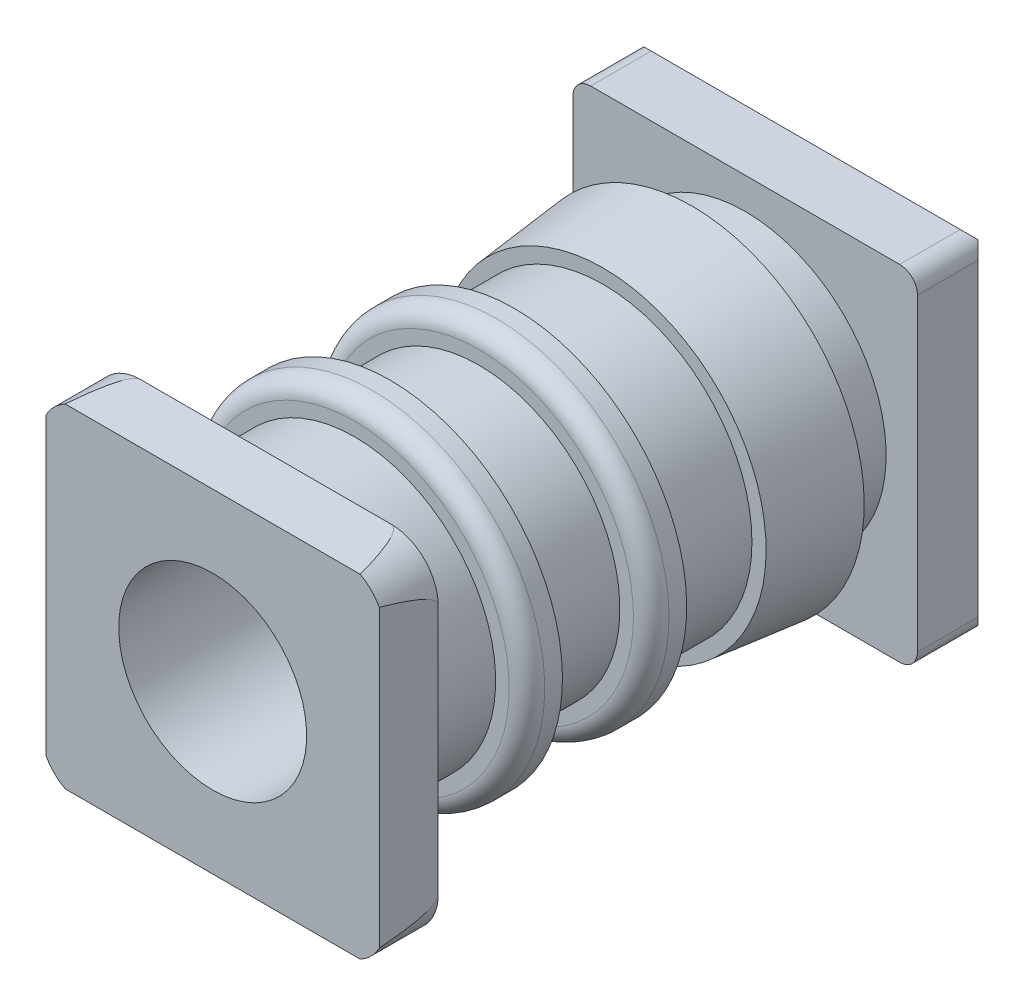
ISO-10303-21;
HEADER;
FILE_DESCRIPTION(('STEP AP214'),'2;1');
FILE_NAME('part.step','',(''),(''),'','','');
FILE_SCHEMA(('AUTOMOTIVE_DESIGN { 1 0 10303 214 1 1 1 1 }'));
ENDSEC;
DATA;
#1=APPLICATION_CONTEXT('core data for automotive mechanical design processes');
#2=APPLICATION_PROTOCOL_DEFINITION('international standard','automotive_design',2000,#1);
#3=PRODUCT_CONTEXT('',#1,'mechanical');
#4=PRODUCT('Part','Part','',(#3));
#5=PRODUCT_RELATED_PRODUCT_CATEGORY('part','',(#4));
#6=PRODUCT_DEFINITION_FORMATION('','',#4);
#7=PRODUCT_DEFINITION_CONTEXT('part definition',#1,'design');
#8=PRODUCT_DEFINITION('design','',#6,#7);
#9=PRODUCT_DEFINITION_SHAPE('','',#8);
#10=(LENGTH_UNIT() NAMED_UNIT(*) SI_UNIT(.MILLI.,.METRE.));
#11=(NAMED_UNIT(*) PLANE_ANGLE_UNIT() SI_UNIT($,.RADIAN.));
#12=(NAMED_UNIT(*) SI_UNIT($,.STERADIAN.) SOLID_ANGLE_UNIT());
#13=UNCERTAINTY_MEASURE_WITH_UNIT(LENGTH_MEASURE(1.E-05),#10,'distance_accuracy_value','');
#14=(GEOMETRIC_REPRESENTATION_CONTEXT(3) GLOBAL_UNCERTAINTY_ASSIGNED_CONTEXT((#13)) GLOBAL_UNIT_ASSIGNED_CONTEXT((#10,
#11,#12)) REPRESENTATION_CONTEXT('',''));
#15=CARTESIAN_POINT('',(0.,0.,0.));
#16=DIRECTION('',(0.,0.,1.));
#17=DIRECTION('',(1.,0.,0.));
#18=AXIS2_PLACEMENT_3D('',#15,#16,#17);
#19=CARTESIAN_POINT('',(-11.,-11.,30.6));
#20=DIRECTION('',(0.,0.,-1.));
#21=DIRECTION('',(0.,1.,0.));
#22=AXIS2_PLACEMENT_3D('',#19,#20,#21);
#23=PLANE('',#22);
#24=CARTESIAN_POINT('',(0.,0.,30.6));
#25=DIRECTION('',(0.,0.,-1.));
#26=DIRECTION('',(0.,1.,0.));
#27=AXIS2_PLACEMENT_3D('',#24,#25,#26);
#28=CIRCLE('',#27,9.);
#29=CARTESIAN_POINT('',(0.,9.,30.6));
#30=VERTEX_POINT('',#29);
#31=EDGE_CURVE('E289',#30,#30,#28,.F.);
#32=ORIENTED_EDGE('',*,*,#31,.T.);
#33=EDGE_LOOP('',(#32));
#34=FACE_BOUND('',#33,.T.);
#35=CARTESIAN_POINT('',(8.,8.,30.6));
#36=DIRECTION('',(0.,0.,-1.));
#37=DIRECTION('',(0.,1.,0.));
#38=AXIS2_PLACEMENT_3D('',#35,#36,#37);
#39=CIRCLE('',#38,3.);
#40=CARTESIAN_POINT('',(11.,8.,30.6));
#41=VERTEX_POINT('',#40);
#42=CARTESIAN_POINT('',(8.,11.,30.6));
#43=VERTEX_POINT('',#42);
#44=EDGE_CURVE('E396',#41,#43,#39,.F.);
#45=ORIENTED_EDGE('',*,*,#44,.F.);
#46=DIRECTION('',(0.,-1.,0.));
#47=VECTOR('',#46,1.);
#48=CARTESIAN_POINT('',(11.,-11.,30.6));
#49=LINE('',#48,#47);
#50=CARTESIAN_POINT('',(11.,-8.,30.6));
#51=VERTEX_POINT('',#50);
#52=EDGE_CURVE('E239',#51,#41,#49,.F.);
#53=ORIENTED_EDGE('',*,*,#52,.F.);
#54=CARTESIAN_POINT('',(8.,-8.,30.6));
#55=DIRECTION('',(0.,0.,-1.));
#56=DIRECTION('',(0.,1.,0.));
#57=AXIS2_PLACEMENT_3D('',#54,#55,#56);
#58=CIRCLE('',#57,3.);
#59=CARTESIAN_POINT('',(8.,-11.,30.6));
#60=VERTEX_POINT('',#59);
#61=EDGE_CURVE('E175',#60,#51,#58,.F.);
#62=ORIENTED_EDGE('',*,*,#61,.F.);
#63=DIRECTION('',(1.,0.,0.));
#64=VECTOR('',#63,1.);
#65=CARTESIAN_POINT('',(11.,-11.,30.6));
#66=LINE('',#65,#64);
#67=CARTESIAN_POINT('',(-8.,-11.,30.6));
#68=VERTEX_POINT('',#67);
#69=EDGE_CURVE('E241',#60,#68,#66,.F.);
#70=ORIENTED_EDGE('',*,*,#69,.T.);
#71=CARTESIAN_POINT('',(-8.,-8.,30.6));
#72=DIRECTION('',(0.,0.,-1.));
#73=DIRECTION('',(0.,1.,0.));
#74=AXIS2_PLACEMENT_3D('',#71,#72,#73);
#75=CIRCLE('',#74,3.);
#76=CARTESIAN_POINT('',(-11.,-8.,30.6));
#77=VERTEX_POINT('',#76);
#78=EDGE_CURVE('E31',#77,#68,#75,.F.);
#79=ORIENTED_EDGE('',*,*,#78,.F.);
#80=DIRECTION('',(0.,-1.,0.));
#81=VECTOR('',#80,1.);
#82=CARTESIAN_POINT('',(-11.,-11.,30.6));
#83=LINE('',#82,#81);
#84=CARTESIAN_POINT('',(-11.,8.,30.6));
#85=VERTEX_POINT('',#84);
#86=EDGE_CURVE('E244',#85,#77,#83,.T.);
#87=ORIENTED_EDGE('',*,*,#86,.F.);
#88=CARTESIAN_POINT('',(-8.,8.,30.6));
#89=DIRECTION('',(0.,0.,-1.));
#90=DIRECTION('',(0.,1.,0.));
#91=AXIS2_PLACEMENT_3D('',#88,#89,#90);
#92=CIRCLE('',#91,3.);
#93=CARTESIAN_POINT('',(-8.,11.,30.6));
#94=VERTEX_POINT('',#93);
#95=EDGE_CURVE('E413',#94,#85,#92,.F.);
#96=ORIENTED_EDGE('',*,*,#95,.F.);
#97=DIRECTION('',(1.,0.,0.));
#98=VECTOR('',#97,1.);
#99=CARTESIAN_POINT('',(11.,11.,30.6));
#100=LINE('',#99,#98);
#101=EDGE_CURVE('E247',#94,#43,#100,.T.);
#102=ORIENTED_EDGE('',*,*,#101,.T.);
#103=EDGE_LOOP('',(#45,#53,#62,#70,#79,#87,#96,#102));
#104=FACE_BOUND('',#103,.T.);
#105=ADVANCED_FACE('F14',(#34,#104),#23,.T.);
#106=CARTESIAN_POINT('',(4.5,0.,34.));
#107=DIRECTION('',(0.,0.,1.));
#108=DIRECTION('',(0.,-1.,0.));
#109=AXIS2_PLACEMENT_3D('',#106,#107,#108);
#110=PLANE('',#109);
#111=CARTESIAN_POINT('',(0.,0.,34.));
#112=DIRECTION('',(0.,0.,-1.));
#113=DIRECTION('',(0.,1.,0.));
#114=AXIS2_PLACEMENT_3D('',#111,#112,#113);
#115=CIRCLE('',#114,6.);
#116=CARTESIAN_POINT('',(0.,6.,34.));
#117=VERTEX_POINT('',#116);
#118=EDGE_CURVE('E417',#117,#117,#115,.T.);
#119=ORIENTED_EDGE('',*,*,#118,.T.);
#120=EDGE_LOOP('',(#119));
#121=FACE_BOUND('',#120,.T.);
#122=CARTESIAN_POINT('',(8.,8.,34.));
#123=DIRECTION('',(0.,0.,-1.));
#124=DIRECTION('',(0.,-1.,0.));
#125=AXIS2_PLACEMENT_3D('',#122,#123,#124);
#126=CIRCLE('',#125,3.);
#127=CARTESIAN_POINT('',(9.42000853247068,10.6426456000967,34.));
#128=VERTEX_POINT('',#127);
#129=CARTESIAN_POINT('',(10.6426456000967,9.42000853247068,34.));
#130=VERTEX_POINT('',#129);
#131=EDGE_CURVE('E38',#128,#130,#126,.T.);
#132=ORIENTED_EDGE('',*,*,#131,.F.);
#133=DIRECTION('',(1.,0.,0.));
#134=VECTOR('',#133,1.);
#135=CARTESIAN_POINT('',(4.5,10.6426456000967,34.));
#136=LINE('',#135,#134);
#137=CARTESIAN_POINT('',(-9.42000853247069,10.6426456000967,34.));
#138=VERTEX_POINT('',#137);
#139=EDGE_CURVE('E205',#128,#138,#136,.F.);
#140=ORIENTED_EDGE('',*,*,#139,.T.);
#141=CARTESIAN_POINT('',(-8.,8.,34.));
#142=DIRECTION('',(0.,0.,1.));
#143=DIRECTION('',(0.,-1.,0.));
#144=AXIS2_PLACEMENT_3D('',#141,#142,#143);
#145=CIRCLE('',#144,3.);
#146=CARTESIAN_POINT('',(-10.6426456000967,9.42000853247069,34.));
#147=VERTEX_POINT('',#146);
#148=EDGE_CURVE('E180',#147,#138,#145,.F.);
#149=ORIENTED_EDGE('',*,*,#148,.F.);
#150=DIRECTION('',(0.,-1.,0.));
#151=VECTOR('',#150,1.);
#152=CARTESIAN_POINT('',(-10.6426456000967,0.,34.));
#153=LINE('',#152,#151);
#154=CARTESIAN_POINT('',(-10.6426456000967,-9.42000853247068,34.));
#155=VERTEX_POINT('',#154);
#156=EDGE_CURVE('E197',#147,#155,#153,.T.);
#157=ORIENTED_EDGE('',*,*,#156,.T.);
#158=CARTESIAN_POINT('',(-8.,-8.,34.));
#159=DIRECTION('',(0.,0.,-1.));
#160=DIRECTION('',(0.,-1.,0.));
#161=AXIS2_PLACEMENT_3D('',#158,#159,#160);
#162=CIRCLE('',#161,3.);
#163=CARTESIAN_POINT('',(-9.42000853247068,-10.6426456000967,34.));
#164=VERTEX_POINT('',#163);
#165=EDGE_CURVE('E190',#164,#155,#162,.T.);
#166=ORIENTED_EDGE('',*,*,#165,.F.);
#167=DIRECTION('',(1.,0.,0.));
#168=VECTOR('',#167,1.);
#169=CARTESIAN_POINT('',(4.5,-10.6426456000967,34.));
#170=LINE('',#169,#168);
#171=CARTESIAN_POINT('',(9.42000853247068,-10.6426456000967,34.));
#172=VERTEX_POINT('',#171);
#173=EDGE_CURVE('E189',#164,#172,#170,.T.);
#174=ORIENTED_EDGE('',*,*,#173,.T.);
#175=CARTESIAN_POINT('',(8.,-8.,34.));
#176=DIRECTION('',(0.,0.,-1.));
#177=DIRECTION('',(0.,-1.,0.));
#178=AXIS2_PLACEMENT_3D('',#175,#176,#177);
#179=CIRCLE('',#178,3.);
#180=CARTESIAN_POINT('',(10.6426456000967,-9.42000853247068,34.));
#181=VERTEX_POINT('',#180);
#182=EDGE_CURVE('E172',#181,#172,#179,.T.);
#183=ORIENTED_EDGE('',*,*,#182,.F.);
#184=DIRECTION('',(0.,-1.,0.));
#185=VECTOR('',#184,1.);
#186=CARTESIAN_POINT('',(10.6426456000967,0.,34.));
#187=LINE('',#186,#185);
#188=EDGE_CURVE('E186',#181,#130,#187,.F.);
#189=ORIENTED_EDGE('',*,*,#188,.T.);
#190=EDGE_LOOP('',(#132,#140,#149,#157,#166,#174,#183,#189));
#191=FACE_BOUND('',#190,.T.);
#192=ADVANCED_FACE('F185',(#121,#191),#110,.T.);
#193=CARTESIAN_POINT('',(0.,0.,15.8666666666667));
#194=DIRECTION('',(0.,0.,1.));
#195=DIRECTION('',(0.,-1.,0.));
#196=AXIS2_PLACEMENT_3D('',#193,#194,#195);
#197=TOROIDAL_SURFACE('',#196,9.86666666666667,1.13333333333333);
#198=CARTESIAN_POINT('',(0.,0.,15.8666666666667));
#199=DIRECTION('',(0.,0.,-1.));
#200=DIRECTION('',(0.,1.,0.));
#201=AXIS2_PLACEMENT_3D('',#198,#199,#200);
#202=CIRCLE('',#201,11.);
#203=CARTESIAN_POINT('',(0.,11.,15.8666666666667));
#204=VERTEX_POINT('',#203);
#205=EDGE_CURVE('E419',#204,#204,#202,.T.);
#206=ORIENTED_EDGE('',*,*,#205,.F.);
#207=EDGE_LOOP('',(#206));
#208=FACE_BOUND('',#207,.T.);
#209=CARTESIAN_POINT('',(0.,0.,17.));
#210=DIRECTION('',(0.,0.,-1.));
#211=DIRECTION('',(0.,1.,0.));
#212=AXIS2_PLACEMENT_3D('',#209,#210,#211);
#213=CIRCLE('',#212,9.86666666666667);
#214=CARTESIAN_POINT('',(9.86666666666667,0.,17.));
#215=VERTEX_POINT('',#214);
#216=CARTESIAN_POINT('',(0.,9.86666666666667,17.));
#217=VERTEX_POINT('',#216);
#218=EDGE_CURVE('E423',#215,#217,#213,.F.);
#219=ORIENTED_EDGE('',*,*,#218,.F.);
#220=CARTESIAN_POINT('',(0.,0.,17.));
#221=DIRECTION('',(0.,0.,-1.));
#222=DIRECTION('',(1.,0.,0.));
#223=AXIS2_PLACEMENT_3D('',#220,#221,#222);
#224=CIRCLE('',#223,9.86666666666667);
#225=CARTESIAN_POINT('',(0.,-9.86666666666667,17.));
#226=VERTEX_POINT('',#225);
#227=EDGE_CURVE('E516',#226,#215,#224,.F.);
#228=ORIENTED_EDGE('',*,*,#227,.F.);
#229=CARTESIAN_POINT('',(0.,0.,17.));
#230=DIRECTION('',(0.,0.,-1.));
#231=DIRECTION('',(0.,-1.,0.));
#232=AXIS2_PLACEMENT_3D('',#229,#230,#231);
#233=CIRCLE('',#232,9.86666666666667);
#234=EDGE_CURVE('E384',#217,#226,#233,.F.);
#235=ORIENTED_EDGE('',*,*,#234,.F.);
#236=EDGE_LOOP('',(#219,#228,#235));
#237=FACE_BOUND('',#236,.T.);
#238=ADVANCED_FACE('F16',(#208,#237),#197,.T.);
#239=CARTESIAN_POINT('',(0.,0.,15.3));
#240=DIRECTION('',(0.,0.,-1.));
#241=DIRECTION('',(0.,1.,0.));
#242=AXIS2_PLACEMENT_3D('',#239,#240,#241);
#243=CYLINDRICAL_SURFACE('',#242,11.);
#244=ORIENTED_EDGE('',*,*,#205,.T.);
#245=EDGE_LOOP('',(#244));
#246=FACE_BOUND('',#245,.T.);
#247=CARTESIAN_POINT('',(0.,0.,14.7333333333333));
#248=DIRECTION('',(0.,0.,-1.));
#249=DIRECTION('',(0.,1.,0.));
#250=AXIS2_PLACEMENT_3D('',#247,#248,#249);
#251=CIRCLE('',#250,11.);
#252=CARTESIAN_POINT('',(0.,11.,14.7333333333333));
#253=VERTEX_POINT('',#252);
#254=EDGE_CURVE('E514',#253,#253,#251,.T.);
#255=ORIENTED_EDGE('',*,*,#254,.F.);
#256=EDGE_LOOP('',(#255));
#257=FACE_BOUND('',#256,.T.);
#258=ADVANCED_FACE('F539',(#246,#257),#243,.T.);
#259=CARTESIAN_POINT('',(9.43333333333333,0.,17.));
#260=DIRECTION('',(0.,0.,1.));
#261=DIRECTION('',(0.,-1.,0.));
#262=AXIS2_PLACEMENT_3D('',#259,#260,#261);
#263=PLANE('',#262);
#264=ORIENTED_EDGE('',*,*,#234,.T.);
#265=ORIENTED_EDGE('',*,*,#227,.T.);
#266=ORIENTED_EDGE('',*,*,#218,.T.);
#267=EDGE_LOOP('',(#264,#265,#266));
#268=FACE_BOUND('',#267,.T.);
#269=CARTESIAN_POINT('',(0.,0.,17.));
#270=DIRECTION('',(0.,0.,-1.));
#271=DIRECTION('',(0.,1.,0.));
#272=AXIS2_PLACEMENT_3D('',#269,#270,#271);
#273=CIRCLE('',#272,9.);
#274=CARTESIAN_POINT('',(0.,9.,17.));
#275=VERTEX_POINT('',#274);
#276=EDGE_CURVE('E512',#275,#275,#273,.F.);
#277=ORIENTED_EDGE('',*,*,#276,.F.);
#278=EDGE_LOOP('',(#277));
#279=FACE_BOUND('',#278,.T.);
#280=ADVANCED_FACE('F522',(#268,#279),#263,.T.);
#281=CARTESIAN_POINT('',(10.25,0.,14.7333333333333));
#282=DIRECTION('',(0.,0.,-1.));
#283=DIRECTION('',(0.,1.,0.));
#284=AXIS2_PLACEMENT_3D('',#281,#282,#283);
#285=PLANE('',#284);
#286=CARTESIAN_POINT('',(0.,0.,14.7333333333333));
#287=DIRECTION('',(0.,0.,-1.));
#288=DIRECTION('',(0.,1.,0.));
#289=AXIS2_PLACEMENT_3D('',#286,#287,#288);
#290=CIRCLE('',#289,9.5);
#291=CARTESIAN_POINT('',(0.,9.5,14.7333333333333));
#292=VERTEX_POINT('',#291);
#293=EDGE_CURVE('E509',#292,#292,#290,.T.);
#294=ORIENTED_EDGE('',*,*,#293,.F.);
#295=EDGE_LOOP('',(#294));
#296=FACE_BOUND('',#295,.T.);
#297=ORIENTED_EDGE('',*,*,#254,.T.);
#298=EDGE_LOOP('',(#297));
#299=FACE_BOUND('',#298,.T.);
#300=ADVANCED_FACE('F538',(#296,#299),#285,.T.);
#301=CARTESIAN_POINT('',(0.,0.,19.8333333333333));
#302=DIRECTION('',(0.,0.,-1.));
#303=DIRECTION('',(0.,1.,0.));
#304=AXIS2_PLACEMENT_3D('',#301,#302,#303);
#305=CYLINDRICAL_SURFACE('',#304,9.);
#306=CARTESIAN_POINT('',(0.,0.,22.6666666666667));
#307=DIRECTION('',(0.,0.,-1.));
#308=DIRECTION('',(0.,1.,0.));
#309=AXIS2_PLACEMENT_3D('',#306,#307,#308);
#310=CIRCLE('',#309,9.);
#311=CARTESIAN_POINT('',(0.,9.,22.6666666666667));
#312=VERTEX_POINT('',#311);
#313=EDGE_CURVE('E506',#312,#312,#310,.F.);
#314=ORIENTED_EDGE('',*,*,#313,.F.);
#315=EDGE_LOOP('',(#314));
#316=FACE_BOUND('',#315,.T.);
#317=ORIENTED_EDGE('',*,*,#276,.T.);
#318=EDGE_LOOP('',(#317));
#319=FACE_BOUND('',#318,.T.);
#320=ADVANCED_FACE('F682',(#316,#319),#305,.T.);
#321=CARTESIAN_POINT('',(0.,0.,11.9));
#322=DIRECTION('',(0.,0.,-1.));
#323=DIRECTION('',(0.,1.,0.));
#324=AXIS2_PLACEMENT_3D('',#321,#322,#323);
#325=CYLINDRICAL_SURFACE('',#324,9.5);
#326=ORIENTED_EDGE('',*,*,#293,.T.);
#327=EDGE_LOOP('',(#326));
#328=FACE_BOUND('',#327,.T.);
#329=CARTESIAN_POINT('',(0.,0.,9.0666666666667));
#330=DIRECTION('',(0.,0.,-1.));
#331=DIRECTION('',(0.,1.,0.));
#332=AXIS2_PLACEMENT_3D('',#329,#330,#331);
#333=CIRCLE('',#332,9.5);
#334=CARTESIAN_POINT('',(0.,9.5,9.0666666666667));
#335=VERTEX_POINT('',#334);
#336=EDGE_CURVE('E503',#335,#335,#333,.T.);
#337=ORIENTED_EDGE('',*,*,#336,.F.);
#338=EDGE_LOOP('',(#337));
#339=FACE_BOUND('',#338,.T.);
#340=ADVANCED_FACE('F680',(#328,#339),#325,.T.);
#341=CARTESIAN_POINT('',(10.,0.,22.6666666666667));
#342=DIRECTION('',(0.,0.,-1.));
#343=DIRECTION('',(0.,1.,0.));
#344=AXIS2_PLACEMENT_3D('',#341,#342,#343);
#345=PLANE('',#344);
#346=ORIENTED_EDGE('',*,*,#313,.T.);
#347=EDGE_LOOP('',(#346));
#348=FACE_BOUND('',#347,.T.);
#349=CARTESIAN_POINT('',(0.,0.,22.6666666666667));
#350=DIRECTION('',(0.,0.,-1.));
#351=DIRECTION('',(0.,1.,0.));
#352=AXIS2_PLACEMENT_3D('',#349,#350,#351);
#353=CIRCLE('',#352,11.);
#354=CARTESIAN_POINT('',(0.,11.,22.6666666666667));
#355=VERTEX_POINT('',#354);
#356=EDGE_CURVE('E500',#355,#355,#353,.F.);
#357=ORIENTED_EDGE('',*,*,#356,.F.);
#358=EDGE_LOOP('',(#357));
#359=FACE_BOUND('',#358,.T.);
#360=ADVANCED_FACE('F676',(#348,#359),#345,.T.);
#361=CARTESIAN_POINT('',(9.95220466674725,0.,9.0666666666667));
#362=DIRECTION('',(0.,0.,1.));
#363=DIRECTION('',(-1.,0.,0.));
#364=AXIS2_PLACEMENT_3D('',#361,#362,#363);
#365=PLANE('',#364);
#366=CARTESIAN_POINT('',(0.,0.,9.0666666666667));
#367=DIRECTION('',(0.,0.,-1.));
#368=DIRECTION('',(0.,1.,0.));
#369=AXIS2_PLACEMENT_3D('',#366,#367,#368);
#370=CIRCLE('',#369,10.4044093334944);
#371=CARTESIAN_POINT('',(0.,10.4044093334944,9.0666666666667));
#372=VERTEX_POINT('',#371);
#373=EDGE_CURVE('E497',#372,#372,#370,.T.);
#374=ORIENTED_EDGE('',*,*,#373,.F.);
#375=EDGE_LOOP('',(#374));
#376=FACE_BOUND('',#375,.T.);
#377=ORIENTED_EDGE('',*,*,#336,.T.);
#378=EDGE_LOOP('',(#377));
#379=FACE_BOUND('',#378,.T.);
#380=ADVANCED_FACE('F670',(#376,#379),#365,.T.);
#381=CARTESIAN_POINT('',(0.,0.,23.2333333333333));
#382=DIRECTION('',(0.,0.,-1.));
#383=DIRECTION('',(0.,1.,0.));
#384=AXIS2_PLACEMENT_3D('',#381,#382,#383);
#385=CYLINDRICAL_SURFACE('',#384,11.);
#386=ORIENTED_EDGE('',*,*,#356,.T.);
#387=EDGE_LOOP('',(#386));
#388=FACE_BOUND('',#387,.T.);
#389=CARTESIAN_POINT('',(0.,0.,23.8));
#390=DIRECTION('',(0.,0.,1.));
#391=DIRECTION('',(0.,-1.,0.));
#392=AXIS2_PLACEMENT_3D('',#389,#390,#391);
#393=CIRCLE('',#392,11.);
#394=CARTESIAN_POINT('',(0.,-11.,23.8));
#395=VERTEX_POINT('',#394);
#396=EDGE_CURVE('E353',#395,#395,#393,.T.);
#397=ORIENTED_EDGE('',*,*,#396,.F.);
#398=EDGE_LOOP('',(#397));
#399=FACE_BOUND('',#398,.T.);
#400=ADVANCED_FACE('F664',(#388,#399),#385,.T.);
#401=CARTESIAN_POINT('',(0.,0.,3.4));
#402=DIRECTION('',(0.,0.,-1.));
#403=DIRECTION('',(0.,1.,0.));
#404=AXIS2_PLACEMENT_3D('',#401,#402,#403);
#405=CONICAL_SURFACE('',#404,11.,0.10471975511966);
#406=ORIENTED_EDGE('',*,*,#373,.T.);
#407=EDGE_LOOP('',(#406));
#408=FACE_BOUND('',#407,.T.);
#409=CARTESIAN_POINT('',(0.,0.,3.4));
#410=DIRECTION('',(0.,0.,-1.));
#411=DIRECTION('',(0.,1.,0.));
#412=AXIS2_PLACEMENT_3D('',#409,#410,#411);
#413=CIRCLE('',#412,11.);
#414=CARTESIAN_POINT('',(0.,11.,3.4));
#415=VERTEX_POINT('',#414);
#416=EDGE_CURVE('E345',#415,#415,#413,.T.);
#417=ORIENTED_EDGE('',*,*,#416,.F.);
#418=EDGE_LOOP('',(#417));
#419=FACE_BOUND('',#418,.T.);
#420=ADVANCED_FACE('F363',(#408,#419),#405,.T.);
#421=CARTESIAN_POINT('',(0.,0.,23.8));
#422=DIRECTION('',(0.,0.,1.));
#423=DIRECTION('',(0.,-1.,0.));
#424=AXIS2_PLACEMENT_3D('',#421,#422,#423);
#425=TOROIDAL_SURFACE('',#424,9.86666666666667,1.13333333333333);
#426=ORIENTED_EDGE('',*,*,#396,.T.);
#427=EDGE_LOOP('',(#426));
#428=FACE_BOUND('',#427,.T.);
#429=CARTESIAN_POINT('',(0.,0.,24.9333333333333));
#430=DIRECTION('',(0.,0.,-1.));
#431=DIRECTION('',(0.,1.,0.));
#432=AXIS2_PLACEMENT_3D('',#429,#430,#431);
#433=CIRCLE('',#432,9.86666666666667);
#434=CARTESIAN_POINT('',(9.86666666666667,0.,24.9333333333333));
#435=VERTEX_POINT('',#434);
#436=CARTESIAN_POINT('',(0.,9.86666666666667,24.9333333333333));
#437=VERTEX_POINT('',#436);
#438=EDGE_CURVE('E300',#435,#437,#433,.F.);
#439=ORIENTED_EDGE('',*,*,#438,.F.);
#440=CARTESIAN_POINT('',(0.,0.,24.9333333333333));
#441=DIRECTION('',(0.,0.,-1.));
#442=DIRECTION('',(1.,0.,0.));
#443=AXIS2_PLACEMENT_3D('',#440,#441,#442);
#444=CIRCLE('',#443,9.86666666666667);
#445=CARTESIAN_POINT('',(0.,-9.86666666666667,24.9333333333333));
#446=VERTEX_POINT('',#445);
#447=EDGE_CURVE('E336',#446,#435,#444,.F.);
#448=ORIENTED_EDGE('',*,*,#447,.F.);
#449=CARTESIAN_POINT('',(0.,0.,24.9333333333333));
#450=DIRECTION('',(0.,0.,-1.));
#451=DIRECTION('',(0.,-1.,0.));
#452=AXIS2_PLACEMENT_3D('',#449,#450,#451);
#453=CIRCLE('',#452,9.86666666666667);
#454=EDGE_CURVE('E338',#437,#446,#453,.F.);
#455=ORIENTED_EDGE('',*,*,#454,.F.);
#456=EDGE_LOOP('',(#439,#448,#455));
#457=FACE_BOUND('',#456,.T.);
#458=ADVANCED_FACE('F343',(#428,#457),#425,.T.);
#459=CARTESIAN_POINT('',(10.,0.,3.4));
#460=DIRECTION('',(0.,0.,-1.));
#461=DIRECTION('',(0.,1.,0.));
#462=AXIS2_PLACEMENT_3D('',#459,#460,#461);
#463=PLANE('',#462);
#464=CARTESIAN_POINT('',(0.,0.,3.4));
#465=DIRECTION('',(0.,0.,-1.));
#466=DIRECTION('',(0.,1.,0.));
#467=AXIS2_PLACEMENT_3D('',#464,#465,#466);
#468=CIRCLE('',#467,9.);
#469=CARTESIAN_POINT('',(0.,9.,3.4));
#470=VERTEX_POINT('',#469);
#471=EDGE_CURVE('E341',#470,#470,#468,.T.);
#472=ORIENTED_EDGE('',*,*,#471,.F.);
#473=EDGE_LOOP('',(#472));
#474=FACE_BOUND('',#473,.T.);
#475=ORIENTED_EDGE('',*,*,#416,.T.);
#476=EDGE_LOOP('',(#475));
#477=FACE_BOUND('',#476,.T.);
#478=ADVANCED_FACE('F318',(#474,#477),#463,.T.);
#479=CARTESIAN_POINT('',(9.43333333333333,0.,24.9333333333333));
#480=DIRECTION('',(0.,0.,1.));
#481=DIRECTION('',(0.,-1.,0.));
#482=AXIS2_PLACEMENT_3D('',#479,#480,#481);
#483=PLANE('',#482);
#484=ORIENTED_EDGE('',*,*,#454,.T.);
#485=ORIENTED_EDGE('',*,*,#447,.T.);
#486=ORIENTED_EDGE('',*,*,#438,.T.);
#487=EDGE_LOOP('',(#484,#485,#486));
#488=FACE_BOUND('',#487,.T.);
#489=CARTESIAN_POINT('',(0.,0.,24.9333333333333));
#490=DIRECTION('',(0.,0.,-1.));
#491=DIRECTION('',(0.,1.,0.));
#492=AXIS2_PLACEMENT_3D('',#489,#490,#491);
#493=CIRCLE('',#492,9.);
#494=CARTESIAN_POINT('',(0.,9.,24.9333333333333));
#495=VERTEX_POINT('',#494);
#496=EDGE_CURVE('E490',#495,#495,#493,.F.);
#497=ORIENTED_EDGE('',*,*,#496,.F.);
#498=EDGE_LOOP('',(#497));
#499=FACE_BOUND('',#498,.T.);
#500=ADVANCED_FACE('F307',(#488,#499),#483,.T.);
#501=CARTESIAN_POINT('',(0.,0.,-0.8));
#502=DIRECTION('',(0.,0.,-1.));
#503=DIRECTION('',(0.,1.,0.));
#504=AXIS2_PLACEMENT_3D('',#501,#502,#503);
#505=CYLINDRICAL_SURFACE('',#504,9.);
#506=CARTESIAN_POINT('',(0.,0.,0.));
#507=DIRECTION('',(0.,0.,-1.));
#508=DIRECTION('',(0.,1.,0.));
#509=AXIS2_PLACEMENT_3D('',#506,#507,#508);
#510=CIRCLE('',#509,9.);
#511=CARTESIAN_POINT('',(0.,9.,0.));
#512=VERTEX_POINT('',#511);
#513=EDGE_CURVE('E583',#512,#512,#510,.T.);
#514=ORIENTED_EDGE('',*,*,#513,.F.);
#515=EDGE_LOOP('',(#514));
#516=FACE_BOUND('',#515,.T.);
#517=ORIENTED_EDGE('',*,*,#471,.T.);
#518=EDGE_LOOP('',(#517));
#519=FACE_BOUND('',#518,.T.);
#520=ADVANCED_FACE('F317',(#516,#519),#505,.T.);
#521=CARTESIAN_POINT('',(0.,0.,29.4666666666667));
#522=DIRECTION('',(0.,0.,-1.));
#523=DIRECTION('',(0.,1.,0.));
#524=AXIS2_PLACEMENT_3D('',#521,#522,#523);
#525=CYLINDRICAL_SURFACE('',#524,9.);
#526=ORIENTED_EDGE('',*,*,#31,.F.);
#527=EDGE_LOOP('',(#526));
#528=FACE_BOUND('',#527,.T.);
#529=ORIENTED_EDGE('',*,*,#496,.T.);
#530=EDGE_LOOP('',(#529));
#531=FACE_BOUND('',#530,.T.);
#532=ADVANCED_FACE('F641',(#528,#531),#525,.T.);
#533=CARTESIAN_POINT('',(-9.86666666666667,-9.86666666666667,-5.));
#534=DIRECTION('',(0.,0.,-1.));
#535=DIRECTION('',(0.,1.,0.));
#536=AXIS2_PLACEMENT_3D('',#533,#534,#535);
#537=CYLINDRICAL_SURFACE('',#536,1.13333333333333);
#538=DIRECTION('',(0.,0.,1.));
#539=VECTOR('',#538,1.);
#540=CARTESIAN_POINT('',(-11.,-9.86666666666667,-5.));
#541=LINE('',#540,#539);
#542=CARTESIAN_POINT('',(-11.,-9.86666666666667,-3.86666666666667));
#543=VERTEX_POINT('',#542);
#544=CARTESIAN_POINT('',(-11.,-9.86666666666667,0.));
#545=VERTEX_POINT('',#544);
#546=EDGE_CURVE('E280',#543,#545,#541,.T.);
#547=ORIENTED_EDGE('',*,*,#546,.F.);
#548=CARTESIAN_POINT('',(-9.86666666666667,-9.86666666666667,-5.));
#549=DIRECTION('',(0.707106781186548,0.,0.707106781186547));
#550=DIRECTION('',(0.707106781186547,0.,-0.707106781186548));
#551=AXIS2_PLACEMENT_3D('',#548,#549,#550);
#552=ELLIPSE('',#551,1.6027753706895,1.13333333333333);
#553=CARTESIAN_POINT('',(-10.6680543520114,-10.6680543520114,-4.19861231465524));
#554=VERTEX_POINT('',#553);
#555=EDGE_CURVE('E466',#543,#554,#552,.T.);
#556=ORIENTED_EDGE('',*,*,#555,.T.);
#557=CARTESIAN_POINT('',(-9.86666666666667,-9.86666666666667,-5.));
#558=DIRECTION('',(0.,0.707106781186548,0.707106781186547));
#559=DIRECTION('',(0.,0.707106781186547,-0.707106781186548));
#560=AXIS2_PLACEMENT_3D('',#557,#558,#559);
#561=ELLIPSE('',#560,1.6027753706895,1.13333333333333);
#562=CARTESIAN_POINT('',(-9.86666666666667,-11.,-3.86666666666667));
#563=VERTEX_POINT('',#562);
#564=EDGE_CURVE('E457',#554,#563,#561,.T.);
#565=ORIENTED_EDGE('',*,*,#564,.T.);
#566=DIRECTION('',(0.,0.,1.));
#567=VECTOR('',#566,1.);
#568=CARTESIAN_POINT('',(-9.86666666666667,-11.,-5.));
#569=LINE('',#568,#567);
#570=CARTESIAN_POINT('',(-9.86666666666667,-11.,0.));
#571=VERTEX_POINT('',#570);
#572=EDGE_CURVE('E282',#571,#563,#569,.F.);
#573=ORIENTED_EDGE('',*,*,#572,.F.);
#574=CARTESIAN_POINT('',(-9.86666666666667,-9.86666666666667,0.));
#575=DIRECTION('',(0.,0.,-1.));
#576=DIRECTION('',(0.,1.,0.));
#577=AXIS2_PLACEMENT_3D('',#574,#575,#576);
#578=CIRCLE('',#577,1.13333333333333);
#579=EDGE_CURVE('E587',#545,#571,#578,.F.);
#580=ORIENTED_EDGE('',*,*,#579,.F.);
#581=EDGE_LOOP('',(#547,#556,#565,#573,#580));
#582=FACE_BOUND('',#581,.T.);
#583=ADVANCED_FACE('F597',(#582),#537,.T.);
#584=CARTESIAN_POINT('',(-9.86666666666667,9.86666666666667,-5.));
#585=DIRECTION('',(0.,0.,-1.));
#586=DIRECTION('',(0.,1.,0.));
#587=AXIS2_PLACEMENT_3D('',#584,#585,#586);
#588=CYLINDRICAL_SURFACE('',#587,1.13333333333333);
#589=CARTESIAN_POINT('',(-9.86666666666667,9.86666666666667,0.));
#590=DIRECTION('',(0.,0.,-1.));
#591=DIRECTION('',(0.,1.,0.));
#592=AXIS2_PLACEMENT_3D('',#589,#590,#591);
#593=CIRCLE('',#592,1.13333333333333);
#594=CARTESIAN_POINT('',(-9.86666666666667,11.,0.));
#595=VERTEX_POINT('',#594);
#596=CARTESIAN_POINT('',(-11.,9.86666666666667,0.));
#597=VERTEX_POINT('',#596);
#598=EDGE_CURVE('E471',#595,#597,#593,.F.);
#599=ORIENTED_EDGE('',*,*,#598,.F.);
#600=DIRECTION('',(0.,0.,1.));
#601=VECTOR('',#600,1.);
#602=CARTESIAN_POINT('',(-9.86666666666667,11.,-5.));
#603=LINE('',#602,#601);
#604=CARTESIAN_POINT('',(-9.86666666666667,11.,-3.86666666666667));
#605=VERTEX_POINT('',#604);
#606=EDGE_CURVE('E274',#605,#595,#603,.T.);
#607=ORIENTED_EDGE('',*,*,#606,.F.);
#608=CARTESIAN_POINT('',(-9.86666666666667,9.86666666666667,-5.));
#609=DIRECTION('',(0.,-0.707106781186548,0.707106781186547));
#610=DIRECTION('',(0.,-0.707106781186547,-0.707106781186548));
#611=AXIS2_PLACEMENT_3D('',#608,#609,#610);
#612=ELLIPSE('',#611,1.6027753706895,1.13333333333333);
#613=CARTESIAN_POINT('',(-10.6680543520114,10.6680543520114,-4.19861231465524));
#614=VERTEX_POINT('',#613);
#615=EDGE_CURVE('E463',#605,#614,#612,.T.);
#616=ORIENTED_EDGE('',*,*,#615,.T.);
#617=CARTESIAN_POINT('',(-9.86666666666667,9.86666666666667,-5.));
#618=DIRECTION('',(0.707106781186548,0.,0.707106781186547));
#619=DIRECTION('',(0.707106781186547,0.,-0.707106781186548));
#620=AXIS2_PLACEMENT_3D('',#617,#618,#619);
#621=ELLIPSE('',#620,1.6027753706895,1.13333333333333);
#622=CARTESIAN_POINT('',(-11.,9.86666666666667,-3.86666666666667));
#623=VERTEX_POINT('',#622);
#624=EDGE_CURVE('E462',#614,#623,#621,.T.);
#625=ORIENTED_EDGE('',*,*,#624,.T.);
#626=DIRECTION('',(0.,0.,1.));
#627=VECTOR('',#626,1.);
#628=CARTESIAN_POINT('',(-11.,9.86666666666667,-5.));
#629=LINE('',#628,#627);
#630=EDGE_CURVE('E276',#597,#623,#629,.F.);
#631=ORIENTED_EDGE('',*,*,#630,.F.);
#632=EDGE_LOOP('',(#599,#607,#616,#625,#631));
#633=FACE_BOUND('',#632,.T.);
#634=ADVANCED_FACE('F469',(#633),#588,.T.);
#635=CARTESIAN_POINT('',(9.86666666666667,9.86666666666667,-5.));
#636=DIRECTION('',(0.,0.,-1.));
#637=DIRECTION('',(0.,1.,0.));
#638=AXIS2_PLACEMENT_3D('',#635,#636,#637);
#639=CYLINDRICAL_SURFACE('',#638,1.13333333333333);
#640=DIRECTION('',(0.,0.,1.));
#641=VECTOR('',#640,1.);
#642=CARTESIAN_POINT('',(11.,9.86666666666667,-5.));
#643=LINE('',#642,#641);
#644=CARTESIAN_POINT('',(11.,9.86666666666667,-3.86666666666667));
#645=VERTEX_POINT('',#644);
#646=CARTESIAN_POINT('',(11.,9.86666666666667,0.));
#647=VERTEX_POINT('',#646);
#648=EDGE_CURVE('E265',#645,#647,#643,.T.);
#649=ORIENTED_EDGE('',*,*,#648,.F.);
#650=CARTESIAN_POINT('',(9.86666666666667,9.86666666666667,-5.));
#651=DIRECTION('',(-0.707106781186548,0.,0.707106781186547));
#652=DIRECTION('',(-0.707106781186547,0.,-0.707106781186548));
#653=AXIS2_PLACEMENT_3D('',#650,#651,#652);
#654=ELLIPSE('',#653,1.6027753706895,1.13333333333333);
#655=CARTESIAN_POINT('',(10.6680543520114,10.6680543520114,-4.19861231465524));
#656=VERTEX_POINT('',#655);
#657=EDGE_CURVE('E482',#645,#656,#654,.T.);
#658=ORIENTED_EDGE('',*,*,#657,.T.);
#659=CARTESIAN_POINT('',(9.86666666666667,9.86666666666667,-5.));
#660=DIRECTION('',(0.,-0.707106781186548,0.707106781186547));
#661=DIRECTION('',(0.,-0.707106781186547,-0.707106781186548));
#662=AXIS2_PLACEMENT_3D('',#659,#660,#661);
#663=ELLIPSE('',#662,1.6027753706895,1.13333333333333);
#664=CARTESIAN_POINT('',(9.86666666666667,11.,-3.86666666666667));
#665=VERTEX_POINT('',#664);
#666=EDGE_CURVE('E445',#656,#665,#663,.T.);
#667=ORIENTED_EDGE('',*,*,#666,.T.);
#668=DIRECTION('',(0.,0.,1.));
#669=VECTOR('',#668,1.);
#670=CARTESIAN_POINT('',(9.86666666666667,11.,-5.));
#671=LINE('',#670,#669);
#672=CARTESIAN_POINT('',(9.86666666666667,11.,0.));
#673=VERTEX_POINT('',#672);
#674=EDGE_CURVE('E267',#673,#665,#671,.F.);
#675=ORIENTED_EDGE('',*,*,#674,.F.);
#676=CARTESIAN_POINT('',(9.86666666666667,9.86666666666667,0.));
#677=DIRECTION('',(0.,0.,-1.));
#678=DIRECTION('',(0.,1.,0.));
#679=AXIS2_PLACEMENT_3D('',#676,#677,#678);
#680=CIRCLE('',#679,1.13333333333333);
#681=EDGE_CURVE('E480',#647,#673,#680,.F.);
#682=ORIENTED_EDGE('',*,*,#681,.F.);
#683=EDGE_LOOP('',(#649,#658,#667,#675,#682));
#684=FACE_BOUND('',#683,.T.);
#685=ADVANCED_FACE('F479',(#684),#639,.T.);
#686=CARTESIAN_POINT('',(0.,0.,0.));
#687=DIRECTION('',(0.,0.,1.));
#688=DIRECTION('',(0.,-1.,0.));
#689=AXIS2_PLACEMENT_3D('',#686,#687,#688);
#690=PLANE('',#689);
#691=ORIENTED_EDGE('',*,*,#513,.T.);
#692=EDGE_LOOP('',(#691));
#693=FACE_BOUND('',#692,.T.);
#694=ORIENTED_EDGE('',*,*,#681,.T.);
#695=DIRECTION('',(-1.,0.,0.));
#696=VECTOR('',#695,1.);
#697=CARTESIAN_POINT('',(-9.86666666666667,11.,0.));
#698=LINE('',#697,#696);
#699=EDGE_CURVE('E273',#595,#673,#698,.F.);
#700=ORIENTED_EDGE('',*,*,#699,.F.);
#701=ORIENTED_EDGE('',*,*,#598,.T.);
#702=DIRECTION('',(0.,-1.,0.));
#703=VECTOR('',#702,1.);
#704=CARTESIAN_POINT('',(-11.,-9.86666666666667,0.));
#705=LINE('',#704,#703);
#706=EDGE_CURVE('E279',#545,#597,#705,.F.);
#707=ORIENTED_EDGE('',*,*,#706,.F.);
#708=ORIENTED_EDGE('',*,*,#579,.T.);
#709=DIRECTION('',(1.,0.,0.));
#710=VECTOR('',#709,1.);
#711=CARTESIAN_POINT('',(9.86666666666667,-11.,0.));
#712=LINE('',#711,#710);
#713=CARTESIAN_POINT('',(9.86666666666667,-11.,0.));
#714=VERTEX_POINT('',#713);
#715=EDGE_CURVE('E285',#714,#571,#712,.F.);
#716=ORIENTED_EDGE('',*,*,#715,.F.);
#717=CARTESIAN_POINT('',(9.86666666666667,-9.86666666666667,0.));
#718=DIRECTION('',(0.,0.,-1.));
#719=DIRECTION('',(0.,1.,0.));
#720=AXIS2_PLACEMENT_3D('',#717,#718,#719);
#721=CIRCLE('',#720,1.13333333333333);
#722=CARTESIAN_POINT('',(11.,-9.86666666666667,0.));
#723=VERTEX_POINT('',#722);
#724=EDGE_CURVE('E579',#723,#714,#721,.T.);
#725=ORIENTED_EDGE('',*,*,#724,.F.);
#726=DIRECTION('',(0.,1.,0.));
#727=VECTOR('',#726,1.);
#728=CARTESIAN_POINT('',(11.,9.86666666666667,0.));
#729=LINE('',#728,#727);
#730=EDGE_CURVE('E264',#647,#723,#729,.F.);
#731=ORIENTED_EDGE('',*,*,#730,.F.);
#732=EDGE_LOOP('',(#694,#700,#701,#707,#708,#716,#725,#731));
#733=FACE_BOUND('',#732,.T.);
#734=ADVANCED_FACE('F590',(#693,#733),#690,.T.);
#735=CARTESIAN_POINT('',(9.86666666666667,-9.86666666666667,-5.));
#736=DIRECTION('',(0.,0.,-1.));
#737=DIRECTION('',(0.,1.,0.));
#738=AXIS2_PLACEMENT_3D('',#735,#736,#737);
#739=CYLINDRICAL_SURFACE('',#738,1.13333333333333);
#740=ORIENTED_EDGE('',*,*,#724,.T.);
#741=DIRECTION('',(0.,0.,1.));
#742=VECTOR('',#741,1.);
#743=CARTESIAN_POINT('',(9.86666666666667,-11.,-5.));
#744=LINE('',#743,#742);
#745=CARTESIAN_POINT('',(9.86666666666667,-11.,-3.86666666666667));
#746=VERTEX_POINT('',#745);
#747=EDGE_CURVE('E286',#746,#714,#744,.T.);
#748=ORIENTED_EDGE('',*,*,#747,.F.);
#749=CARTESIAN_POINT('',(9.86666666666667,-9.86666666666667,-5.));
#750=DIRECTION('',(0.,0.707106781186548,0.707106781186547));
#751=DIRECTION('',(0.,0.707106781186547,-0.707106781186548));
#752=AXIS2_PLACEMENT_3D('',#749,#750,#751);
#753=ELLIPSE('',#752,1.6027753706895,1.13333333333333);
#754=CARTESIAN_POINT('',(10.6680543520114,-10.6680543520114,-4.19861231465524));
#755=VERTEX_POINT('',#754);
#756=EDGE_CURVE('E453',#746,#755,#753,.T.);
#757=ORIENTED_EDGE('',*,*,#756,.T.);
#758=CARTESIAN_POINT('',(9.86666666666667,-9.86666666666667,-5.));
#759=DIRECTION('',(-0.707106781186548,0.,0.707106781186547));
#760=DIRECTION('',(-0.707106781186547,0.,-0.707106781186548));
#761=AXIS2_PLACEMENT_3D('',#758,#759,#760);
#762=ELLIPSE('',#761,1.6027753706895,1.13333333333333);
#763=CARTESIAN_POINT('',(11.,-9.86666666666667,-3.86666666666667));
#764=VERTEX_POINT('',#763);
#765=EDGE_CURVE('E449',#755,#764,#762,.T.);
#766=ORIENTED_EDGE('',*,*,#765,.T.);
#767=DIRECTION('',(0.,0.,1.));
#768=VECTOR('',#767,1.);
#769=CARTESIAN_POINT('',(11.,-9.86666666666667,-5.));
#770=LINE('',#769,#768);
#771=EDGE_CURVE('E250',#723,#764,#770,.F.);
#772=ORIENTED_EDGE('',*,*,#771,.F.);
#773=EDGE_LOOP('',(#740,#748,#757,#766,#772));
#774=FACE_BOUND('',#773,.T.);
#775=ADVANCED_FACE('F603',(#774),#739,.T.);
#776=CARTESIAN_POINT('',(9.86666666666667,-11.,-5.));
#777=DIRECTION('',(0.,-1.,0.));
#778=DIRECTION('',(1.,0.,0.));
#779=AXIS2_PLACEMENT_3D('',#776,#777,#778);
#780=PLANE('',#779);
#781=ORIENTED_EDGE('',*,*,#715,.T.);
#782=ORIENTED_EDGE('',*,*,#572,.T.);
#783=DIRECTION('',(1.,0.,0.));
#784=VECTOR('',#783,1.);
#785=CARTESIAN_POINT('',(22.,-11.,-3.86666666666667));
#786=LINE('',#785,#784);
#787=EDGE_CURVE('E236',#563,#746,#786,.T.);
#788=ORIENTED_EDGE('',*,*,#787,.T.);
#789=ORIENTED_EDGE('',*,*,#747,.T.);
#790=EDGE_LOOP('',(#781,#782,#788,#789));
#791=FACE_BOUND('',#790,.T.);
#792=ADVANCED_FACE('F601',(#791),#780,.T.);
#793=CARTESIAN_POINT('',(-11.,-9.86666666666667,-5.));
#794=DIRECTION('',(-1.,0.,0.));
#795=DIRECTION('',(0.,-1.,0.));
#796=AXIS2_PLACEMENT_3D('',#793,#794,#795);
#797=PLANE('',#796);
#798=ORIENTED_EDGE('',*,*,#706,.T.);
#799=ORIENTED_EDGE('',*,*,#630,.T.);
#800=DIRECTION('',(0.,-1.,0.));
#801=VECTOR('',#800,1.);
#802=CARTESIAN_POINT('',(-11.,-22.,-3.86666666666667));
#803=LINE('',#802,#801);
#804=EDGE_CURVE('E231',#623,#543,#803,.T.);
#805=ORIENTED_EDGE('',*,*,#804,.T.);
#806=ORIENTED_EDGE('',*,*,#546,.T.);
#807=EDGE_LOOP('',(#798,#799,#805,#806));
#808=FACE_BOUND('',#807,.T.);
#809=ADVANCED_FACE('F592',(#808),#797,.T.);
#810=CARTESIAN_POINT('',(-9.86666666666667,11.,-5.));
#811=DIRECTION('',(0.,1.,0.));
#812=DIRECTION('',(-1.,0.,0.));
#813=AXIS2_PLACEMENT_3D('',#810,#811,#812);
#814=PLANE('',#813);
#815=ORIENTED_EDGE('',*,*,#699,.T.);
#816=ORIENTED_EDGE('',*,*,#674,.T.);
#817=DIRECTION('',(1.,0.,0.));
#818=VECTOR('',#817,1.);
#819=CARTESIAN_POINT('',(22.,11.,-3.86666666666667));
#820=LINE('',#819,#818);
#821=EDGE_CURVE('E223',#665,#605,#820,.F.);
#822=ORIENTED_EDGE('',*,*,#821,.T.);
#823=ORIENTED_EDGE('',*,*,#606,.T.);
#824=EDGE_LOOP('',(#815,#816,#822,#823));
#825=FACE_BOUND('',#824,.T.);
#826=ADVANCED_FACE('F474',(#825),#814,.T.);
#827=CARTESIAN_POINT('',(11.,9.86666666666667,-5.));
#828=DIRECTION('',(1.,0.,0.));
#829=DIRECTION('',(0.,1.,0.));
#830=AXIS2_PLACEMENT_3D('',#827,#828,#829);
#831=PLANE('',#830);
#832=ORIENTED_EDGE('',*,*,#730,.T.);
#833=ORIENTED_EDGE('',*,*,#771,.T.);
#834=DIRECTION('',(0.,-1.,0.));
#835=VECTOR('',#834,1.);
#836=CARTESIAN_POINT('',(11.,-22.,-3.86666666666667));
#837=LINE('',#836,#835);
#838=EDGE_CURVE('E215',#764,#645,#837,.F.);
#839=ORIENTED_EDGE('',*,*,#838,.T.);
#840=ORIENTED_EDGE('',*,*,#648,.T.);
#841=EDGE_LOOP('',(#832,#833,#839,#840));
#842=FACE_BOUND('',#841,.T.);
#843=ADVANCED_FACE('F606',(#842),#831,.T.);
#844=CARTESIAN_POINT('',(11.,10.6426456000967,34.));
#845=DIRECTION('',(0.,-0.994521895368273,-0.104528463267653));
#846=DIRECTION('',(0.,0.104528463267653,-0.994521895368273));
#847=AXIS2_PLACEMENT_3D('',#844,#845,#846);
#848=PLANE('',#847);
#849=ORIENTED_EDGE('',*,*,#139,.F.);
#850=CARTESIAN_POINT('',(8.,8.,59.1430933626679));
#851=DIRECTION('',(0.,-0.994521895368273,-0.104528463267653));
#852=DIRECTION('',(0.,-0.104528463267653,0.994521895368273));
#853=AXIS2_PLACEMENT_3D('',#850,#851,#852);
#854=ELLIPSE('',#853,28.700316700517,3.);
#855=EDGE_CURVE('E401',#128,#43,#854,.F.);
#856=ORIENTED_EDGE('',*,*,#855,.T.);
#857=ORIENTED_EDGE('',*,*,#101,.F.);
#858=CARTESIAN_POINT('',(-8.,8.,59.1430933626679));
#859=DIRECTION('',(0.,-0.994521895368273,-0.104528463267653));
#860=DIRECTION('',(0.,-0.104528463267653,0.994521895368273));
#861=AXIS2_PLACEMENT_3D('',#858,#859,#860);
#862=ELLIPSE('',#861,28.700316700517,3.);
#863=EDGE_CURVE('E415',#94,#138,#862,.F.);
#864=ORIENTED_EDGE('',*,*,#863,.T.);
#865=EDGE_LOOP('',(#849,#856,#857,#864));
#866=FACE_BOUND('',#865,.T.);
#867=ADVANCED_FACE('F608',(#866),#848,.F.);
#868=CARTESIAN_POINT('',(-10.6426456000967,-11.,34.));
#869=DIRECTION('',(-0.994521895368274,0.,0.104528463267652));
#870=DIRECTION('',(-0.104528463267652,0.,-0.994521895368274));
#871=AXIS2_PLACEMENT_3D('',#868,#869,#870);
#872=PLANE('',#871);
#873=CARTESIAN_POINT('',(-8.,-8.,59.1430933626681));
#874=DIRECTION('',(-0.994521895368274,0.,0.104528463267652));
#875=DIRECTION('',(0.104528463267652,0.,0.994521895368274));
#876=AXIS2_PLACEMENT_3D('',#873,#874,#875);
#877=ELLIPSE('',#876,28.7003167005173,3.);
#878=EDGE_CURVE('E409',#155,#77,#877,.F.);
#879=ORIENTED_EDGE('',*,*,#878,.F.);
#880=ORIENTED_EDGE('',*,*,#156,.F.);
#881=CARTESIAN_POINT('',(-8.,8.,59.1430933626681));
#882=DIRECTION('',(-0.994521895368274,0.,0.104528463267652));
#883=DIRECTION('',(0.104528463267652,0.,0.994521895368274));
#884=AXIS2_PLACEMENT_3D('',#881,#882,#883);
#885=ELLIPSE('',#884,28.7003167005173,3.);
#886=EDGE_CURVE('E411',#85,#147,#885,.F.);
#887=ORIENTED_EDGE('',*,*,#886,.F.);
#888=ORIENTED_EDGE('',*,*,#86,.T.);
#889=EDGE_LOOP('',(#879,#880,#887,#888));
#890=FACE_BOUND('',#889,.T.);
#891=ADVANCED_FACE('F616',(#890),#872,.T.);
#892=CARTESIAN_POINT('',(11.,-11.,30.6));
#893=DIRECTION('',(0.,0.994521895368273,-0.104528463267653));
#894=DIRECTION('',(0.,0.104528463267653,0.994521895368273));
#895=AXIS2_PLACEMENT_3D('',#892,#893,#894);
#896=PLANE('',#895);
#897=ORIENTED_EDGE('',*,*,#69,.F.);
#898=CARTESIAN_POINT('',(8.,-8.,59.1430933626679));
#899=DIRECTION('',(0.,0.994521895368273,-0.104528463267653));
#900=DIRECTION('',(0.,0.104528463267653,0.994521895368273));
#901=AXIS2_PLACEMENT_3D('',#898,#899,#900);
#902=ELLIPSE('',#901,28.700316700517,3.);
#903=EDGE_CURVE('E402',#60,#172,#902,.F.);
#904=ORIENTED_EDGE('',*,*,#903,.T.);
#905=ORIENTED_EDGE('',*,*,#173,.F.);
#906=CARTESIAN_POINT('',(-8.,-8.,59.1430933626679));
#907=DIRECTION('',(0.,0.994521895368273,-0.104528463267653));
#908=DIRECTION('',(0.,0.104528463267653,0.994521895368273));
#909=AXIS2_PLACEMENT_3D('',#906,#907,#908);
#910=ELLIPSE('',#909,28.700316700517,3.);
#911=EDGE_CURVE('E9',#164,#68,#910,.F.);
#912=ORIENTED_EDGE('',*,*,#911,.T.);
#913=EDGE_LOOP('',(#897,#904,#905,#912));
#914=FACE_BOUND('',#913,.T.);
#915=ADVANCED_FACE('F912',(#914),#896,.F.);
#916=CARTESIAN_POINT('',(11.,-11.,30.6));
#917=DIRECTION('',(0.994521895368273,0.,0.104528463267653));
#918=DIRECTION('',(-0.104528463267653,0.,0.994521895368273));
#919=AXIS2_PLACEMENT_3D('',#916,#917,#918);
#920=PLANE('',#919);
#921=CARTESIAN_POINT('',(8.,8.,59.1430933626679));
#922=DIRECTION('',(0.994521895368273,0.,0.104528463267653));
#923=DIRECTION('',(-0.104528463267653,0.,0.994521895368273));
#924=AXIS2_PLACEMENT_3D('',#921,#922,#923);
#925=ELLIPSE('',#924,28.700316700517,3.);
#926=EDGE_CURVE('E24',#130,#41,#925,.F.);
#927=ORIENTED_EDGE('',*,*,#926,.F.);
#928=ORIENTED_EDGE('',*,*,#188,.F.);
#929=CARTESIAN_POINT('',(8.,-8.,59.1430933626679));
#930=DIRECTION('',(0.994521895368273,0.,0.104528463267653));
#931=DIRECTION('',(-0.104528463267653,0.,0.994521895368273));
#932=AXIS2_PLACEMENT_3D('',#929,#930,#931);
#933=ELLIPSE('',#932,28.700316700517,3.);
#934=EDGE_CURVE('E169',#51,#181,#933,.F.);
#935=ORIENTED_EDGE('',*,*,#934,.F.);
#936=ORIENTED_EDGE('',*,*,#52,.T.);
#937=EDGE_LOOP('',(#927,#928,#935,#936));
#938=FACE_BOUND('',#937,.T.);
#939=ADVANCED_FACE('F192',(#938),#920,.T.);
#940=CARTESIAN_POINT('',(22.,-9.86666666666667,-5.));
#941=DIRECTION('',(0.,0.707106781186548,0.707106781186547));
#942=DIRECTION('',(0.,-0.707106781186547,0.707106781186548));
#943=AXIS2_PLACEMENT_3D('',#940,#941,#942);
#944=PLANE('',#943);
#945=ORIENTED_EDGE('',*,*,#787,.F.);
#946=ORIENTED_EDGE('',*,*,#564,.F.);
#947=DIRECTION('',(0.57735026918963,0.577350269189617,-0.577350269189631));
#948=VECTOR('',#947,1.);
#949=CARTESIAN_POINT('',(-10.6680543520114,-10.6680543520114,-4.19861231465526));
#950=LINE('',#949,#948);
#951=CARTESIAN_POINT('',(-9.86666666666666,-9.86666666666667,-5.));
#952=VERTEX_POINT('',#951);
#953=EDGE_CURVE('E228',#554,#952,#950,.T.);
#954=ORIENTED_EDGE('',*,*,#953,.T.);
#955=DIRECTION('',(1.,0.,0.));
#956=VECTOR('',#955,1.);
#957=CARTESIAN_POINT('',(4.5,-9.86666666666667,-5.));
#958=LINE('',#957,#956);
#959=CARTESIAN_POINT('',(9.86666666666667,-9.86666666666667,-5.));
#960=VERTEX_POINT('',#959);
#961=EDGE_CURVE('E193',#960,#952,#958,.F.);
#962=ORIENTED_EDGE('',*,*,#961,.F.);
#963=DIRECTION('',(0.577350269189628,-0.57735026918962,0.577350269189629));
#964=VECTOR('',#963,1.);
#965=CARTESIAN_POINT('',(9.86666666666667,-9.86666666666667,-5.));
#966=LINE('',#965,#964);
#967=EDGE_CURVE('E207',#960,#755,#966,.T.);
#968=ORIENTED_EDGE('',*,*,#967,.T.);
#969=ORIENTED_EDGE('',*,*,#756,.F.);
#970=EDGE_LOOP('',(#945,#946,#954,#962,#968,#969));
#971=FACE_BOUND('',#970,.T.);
#972=ADVANCED_FACE('F452',(#971),#944,.F.);
#973=CARTESIAN_POINT('',(-9.86666666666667,-22.,-5.));
#974=DIRECTION('',(0.707106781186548,0.,0.707106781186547));
#975=DIRECTION('',(-0.707106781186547,0.,0.707106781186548));
#976=AXIS2_PLACEMENT_3D('',#973,#974,#975);
#977=PLANE('',#976);
#978=ORIENTED_EDGE('',*,*,#555,.F.);
#979=ORIENTED_EDGE('',*,*,#804,.F.);
#980=ORIENTED_EDGE('',*,*,#624,.F.);
#981=DIRECTION('',(0.577350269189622,-0.577350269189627,-0.577350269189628));
#982=VECTOR('',#981,1.);
#983=CARTESIAN_POINT('',(-10.6680543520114,10.6680543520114,-4.19861231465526));
#984=LINE('',#983,#982);
#985=CARTESIAN_POINT('',(-9.86666666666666,9.86666666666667,-5.));
#986=VERTEX_POINT('',#985);
#987=EDGE_CURVE('E220',#614,#986,#984,.T.);
#988=ORIENTED_EDGE('',*,*,#987,.T.);
#989=DIRECTION('',(0.,1.,0.));
#990=VECTOR('',#989,1.);
#991=CARTESIAN_POINT('',(-9.86666666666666,0.,-5.));
#992=LINE('',#991,#990);
#993=EDGE_CURVE('E195',#952,#986,#992,.T.);
#994=ORIENTED_EDGE('',*,*,#993,.F.);
#995=ORIENTED_EDGE('',*,*,#953,.F.);
#996=EDGE_LOOP('',(#978,#979,#980,#988,#994,#995));
#997=FACE_BOUND('',#996,.T.);
#998=ADVANCED_FACE('F459',(#997),#977,.F.);
#999=CARTESIAN_POINT('',(22.,11.,-3.86666666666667));
#1000=DIRECTION('',(0.,-0.707106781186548,0.707106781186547));
#1001=DIRECTION('',(0.,-0.707106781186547,-0.707106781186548));
#1002=AXIS2_PLACEMENT_3D('',#999,#1000,#1001);
#1003=PLANE('',#1002);
#1004=DIRECTION('',(-0.577350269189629,-0.577350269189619,-0.57735026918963));
#1005=VECTOR('',#1004,1.);
#1006=CARTESIAN_POINT('',(10.6680543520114,10.6680543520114,-4.19861231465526));
#1007=LINE('',#1006,#1005);
#1008=CARTESIAN_POINT('',(9.86666666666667,9.86666666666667,-5.));
#1009=VERTEX_POINT('',#1008);
#1010=EDGE_CURVE('E210',#656,#1009,#1007,.T.);
#1011=ORIENTED_EDGE('',*,*,#1010,.T.);
#1012=DIRECTION('',(1.,0.,0.));
#1013=VECTOR('',#1012,1.);
#1014=CARTESIAN_POINT('',(4.5,9.86666666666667,-5.));
#1015=LINE('',#1014,#1013);
#1016=EDGE_CURVE('E254',#986,#1009,#1015,.T.);
#1017=ORIENTED_EDGE('',*,*,#1016,.F.);
#1018=ORIENTED_EDGE('',*,*,#987,.F.);
#1019=ORIENTED_EDGE('',*,*,#615,.F.);
#1020=ORIENTED_EDGE('',*,*,#821,.F.);
#1021=ORIENTED_EDGE('',*,*,#666,.F.);
#1022=EDGE_LOOP('',(#1011,#1017,#1018,#1019,#1020,#1021));
#1023=FACE_BOUND('',#1022,.T.);
#1024=ADVANCED_FACE('F443',(#1023),#1003,.F.);
#1025=CARTESIAN_POINT('',(11.,-22.,-3.86666666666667));
#1026=DIRECTION('',(-0.707106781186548,0.,0.707106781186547));
#1027=DIRECTION('',(-0.707106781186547,0.,-0.707106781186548));
#1028=AXIS2_PLACEMENT_3D('',#1025,#1026,#1027);
#1029=PLANE('',#1028);
#1030=DIRECTION('',(0.,1.,0.));
#1031=VECTOR('',#1030,1.);
#1032=CARTESIAN_POINT('',(9.86666666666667,0.,-5.));
#1033=LINE('',#1032,#1031);
#1034=EDGE_CURVE('E251',#1009,#960,#1033,.F.);
#1035=ORIENTED_EDGE('',*,*,#1034,.F.);
#1036=ORIENTED_EDGE('',*,*,#1010,.F.);
#1037=ORIENTED_EDGE('',*,*,#657,.F.);
#1038=ORIENTED_EDGE('',*,*,#838,.F.);
#1039=ORIENTED_EDGE('',*,*,#765,.F.);
#1040=ORIENTED_EDGE('',*,*,#967,.F.);
#1041=EDGE_LOOP('',(#1035,#1036,#1037,#1038,#1039,#1040));
#1042=FACE_BOUND('',#1041,.T.);
#1043=ADVANCED_FACE('F433',(#1042),#1029,.F.);
#1044=CARTESIAN_POINT('',(4.5,0.,-5.));
#1045=DIRECTION('',(0.,0.,-1.));
#1046=DIRECTION('',(0.,1.,0.));
#1047=AXIS2_PLACEMENT_3D('',#1044,#1045,#1046);
#1048=PLANE('',#1047);
#1049=CARTESIAN_POINT('',(0.,0.,-5.));
#1050=DIRECTION('',(0.,0.,-1.));
#1051=DIRECTION('',(0.,1.,0.));
#1052=AXIS2_PLACEMENT_3D('',#1049,#1050,#1051);
#1053=CIRCLE('',#1052,6.);
#1054=CARTESIAN_POINT('',(0.,6.,-5.));
#1055=VERTEX_POINT('',#1054);
#1056=EDGE_CURVE('E200',#1055,#1055,#1053,.T.);
#1057=ORIENTED_EDGE('',*,*,#1056,.F.);
#1058=EDGE_LOOP('',(#1057));
#1059=FACE_BOUND('',#1058,.T.);
#1060=ORIENTED_EDGE('',*,*,#1016,.T.);
#1061=ORIENTED_EDGE('',*,*,#1034,.T.);
#1062=ORIENTED_EDGE('',*,*,#961,.T.);
#1063=ORIENTED_EDGE('',*,*,#993,.T.);
#1064=EDGE_LOOP('',(#1060,#1061,#1062,#1063));
#1065=FACE_BOUND('',#1064,.T.);
#1066=ADVANCED_FACE('F430',(#1059,#1065),#1048,.T.);
#1067=CARTESIAN_POINT('',(0.,0.,34.));
#1068=DIRECTION('',(0.,0.,-1.));
#1069=DIRECTION('',(0.,1.,0.));
#1070=AXIS2_PLACEMENT_3D('',#1067,#1068,#1069);
#1071=CYLINDRICAL_SURFACE('',#1070,6.);
#1072=ORIENTED_EDGE('',*,*,#118,.F.);
#1073=EDGE_LOOP('',(#1072));
#1074=FACE_BOUND('',#1073,.T.);
#1075=ORIENTED_EDGE('',*,*,#1056,.T.);
#1076=EDGE_LOOP('',(#1075));
#1077=FACE_BOUND('',#1076,.T.);
#1078=ADVANCED_FACE('F428',(#1074,#1077),#1071,.F.);
#1079=CARTESIAN_POINT('',(-8.,8.,24.));
#1080=DIRECTION('',(0.,0.,1.));
#1081=DIRECTION('',(0.,-1.,0.));
#1082=AXIS2_PLACEMENT_3D('',#1079,#1080,#1081);
#1083=CYLINDRICAL_SURFACE('',#1082,3.);
#1084=ORIENTED_EDGE('',*,*,#95,.T.);
#1085=ORIENTED_EDGE('',*,*,#886,.T.);
#1086=ORIENTED_EDGE('',*,*,#148,.T.);
#1087=ORIENTED_EDGE('',*,*,#863,.F.);
#1088=EDGE_LOOP('',(#1084,#1085,#1086,#1087));
#1089=FACE_BOUND('',#1088,.T.);
#1090=ADVANCED_FACE('F851',(#1089),#1083,.T.);
#1091=CARTESIAN_POINT('',(8.,-8.,24.));
#1092=DIRECTION('',(0.,0.,1.));
#1093=DIRECTION('',(0.,-1.,0.));
#1094=AXIS2_PLACEMENT_3D('',#1091,#1092,#1093);
#1095=CYLINDRICAL_SURFACE('',#1094,3.);
#1096=ORIENTED_EDGE('',*,*,#61,.T.);
#1097=ORIENTED_EDGE('',*,*,#934,.T.);
#1098=ORIENTED_EDGE('',*,*,#182,.T.);
#1099=ORIENTED_EDGE('',*,*,#903,.F.);
#1100=EDGE_LOOP('',(#1096,#1097,#1098,#1099));
#1101=FACE_BOUND('',#1100,.T.);
#1102=ADVANCED_FACE('F171',(#1101),#1095,.T.);
#1103=CARTESIAN_POINT('',(8.,8.,24.));
#1104=DIRECTION('',(0.,0.,1.));
#1105=DIRECTION('',(0.,-1.,0.));
#1106=AXIS2_PLACEMENT_3D('',#1103,#1104,#1105);
#1107=CYLINDRICAL_SURFACE('',#1106,3.);
#1108=ORIENTED_EDGE('',*,*,#131,.T.);
#1109=ORIENTED_EDGE('',*,*,#926,.T.);
#1110=ORIENTED_EDGE('',*,*,#44,.T.);
#1111=ORIENTED_EDGE('',*,*,#855,.F.);
#1112=EDGE_LOOP('',(#1108,#1109,#1110,#1111));
#1113=FACE_BOUND('',#1112,.T.);
#1114=ADVANCED_FACE('F395',(#1113),#1107,.T.);
#1115=CARTESIAN_POINT('',(-8.,-8.,24.));
#1116=DIRECTION('',(0.,0.,1.));
#1117=DIRECTION('',(0.,-1.,0.));
#1118=AXIS2_PLACEMENT_3D('',#1115,#1116,#1117);
#1119=CYLINDRICAL_SURFACE('',#1118,3.);
#1120=ORIENTED_EDGE('',*,*,#878,.T.);
#1121=ORIENTED_EDGE('',*,*,#78,.T.);
#1122=ORIENTED_EDGE('',*,*,#911,.F.);
#1123=ORIENTED_EDGE('',*,*,#165,.T.);
#1124=EDGE_LOOP('',(#1120,#1121,#1122,#1123));
#1125=FACE_BOUND('',#1124,.T.);
#1126=ADVANCED_FACE('F874',(#1125),#1119,.T.);
#1127=CLOSED_SHELL('',(#105,#192,#238,#258,#280,#300,#320,#340,#360,#380,#400,#420,#458,#478,
#500,#520,#532,#583,#634,#685,#734,#775,#792,#809,#826,#843,#867,#891,#915,#939,#972,#998,#1024,
#1043,#1066,#1078,#1090,#1102,#1114,#1126));
#1128=MANIFOLD_SOLID_BREP('B1',#1127);
#1129=ADVANCED_BREP_SHAPE_REPRESENTATION('',(#18,#1128),#14);
#1130=SHAPE_DEFINITION_REPRESENTATION(#9,#1129);
ENDSEC;
END-ISO-10303-21;
